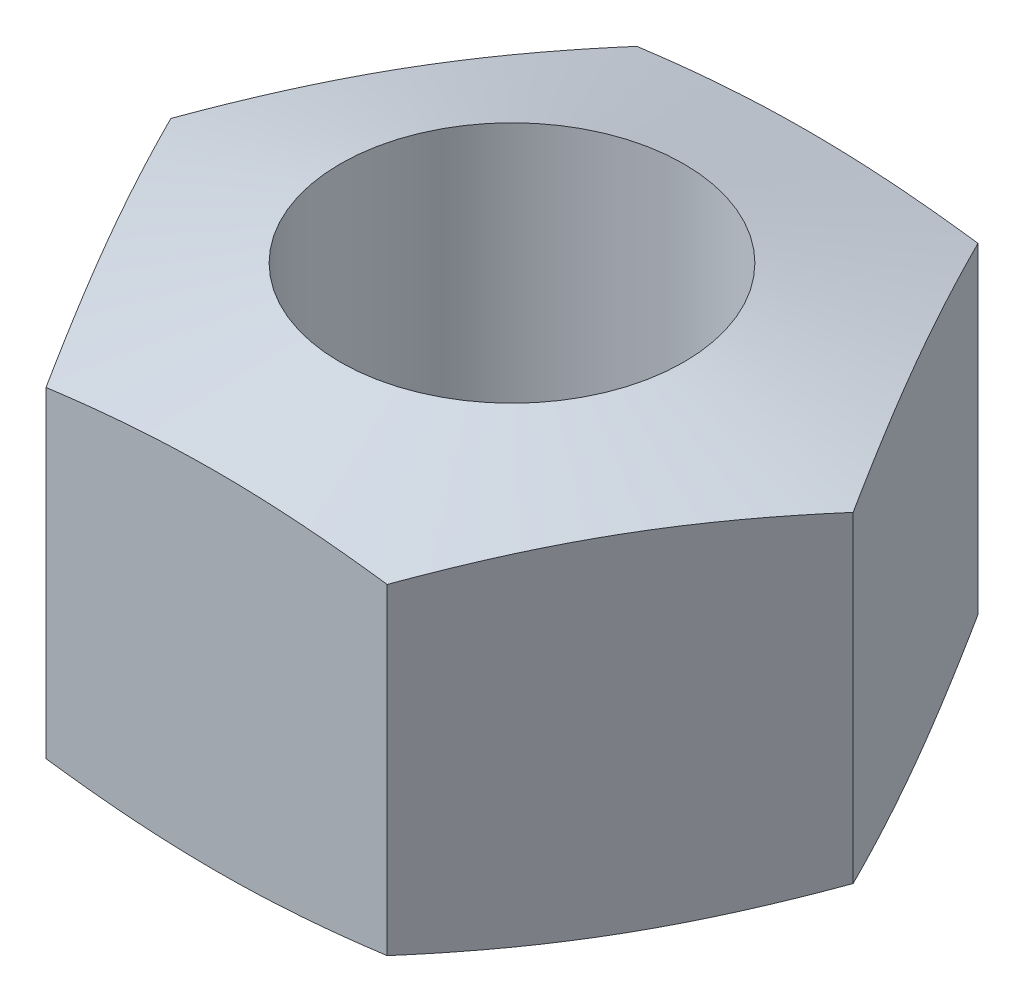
ISO-10303-21;
HEADER;
FILE_DESCRIPTION(('STEP AP214'),'2;1');
FILE_NAME('part.step','',(''),(''),'','','');
FILE_SCHEMA(('AUTOMOTIVE_DESIGN { 1 0 10303 214 1 1 1 1 }'));
ENDSEC;
DATA;
#1=APPLICATION_CONTEXT('core data for automotive mechanical design processes');
#2=APPLICATION_PROTOCOL_DEFINITION('international standard','automotive_design',2000,#1);
#3=PRODUCT_CONTEXT('',#1,'mechanical');
#4=PRODUCT('Part','Part','',(#3));
#5=PRODUCT_RELATED_PRODUCT_CATEGORY('part','',(#4));
#6=PRODUCT_DEFINITION_FORMATION('','',#4);
#7=PRODUCT_DEFINITION_CONTEXT('part definition',#1,'design');
#8=PRODUCT_DEFINITION('design','',#6,#7);
#9=PRODUCT_DEFINITION_SHAPE('','',#8);
#10=(LENGTH_UNIT() NAMED_UNIT(*) SI_UNIT(.MILLI.,.METRE.));
#11=(NAMED_UNIT(*) PLANE_ANGLE_UNIT() SI_UNIT($,.RADIAN.));
#12=(NAMED_UNIT(*) SI_UNIT($,.STERADIAN.) SOLID_ANGLE_UNIT());
#13=UNCERTAINTY_MEASURE_WITH_UNIT(LENGTH_MEASURE(1.E-05),#10,'distance_accuracy_value','');
#14=(GEOMETRIC_REPRESENTATION_CONTEXT(3) GLOBAL_UNCERTAINTY_ASSIGNED_CONTEXT((#13)) GLOBAL_UNIT_ASSIGNED_CONTEXT((#10,
#11,#12)) REPRESENTATION_CONTEXT('',''));
#15=CARTESIAN_POINT('',(0.,0.,0.));
#16=DIRECTION('',(0.,0.,1.));
#17=DIRECTION('',(1.,0.,0.));
#18=AXIS2_PLACEMENT_3D('',#15,#16,#17);
#19=CARTESIAN_POINT('',(1.24130307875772,1.5,2.14999999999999));
#20=DIRECTION('',(-0.866025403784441,0.,-0.499999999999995));
#21=DIRECTION('',(-0.499999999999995,0.,0.866025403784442));
#22=AXIS2_PLACEMENT_3D('',#19,#20,#21);
#23=PLANE('',#22);
#24=DIRECTION('',(0.,-1.,0.));
#25=VECTOR('',#24,1.);
#26=CARTESIAN_POINT('',(1.24130307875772,1.5,2.14999999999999));
#27=LINE('',#26,#25);
#28=CARTESIAN_POINT('',(1.24130307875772,1.16972417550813,2.14999999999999));
#29=VERTEX_POINT('',#28);
#30=CARTESIAN_POINT('',(1.24130307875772,-1.16972417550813,2.14999999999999));
#31=VERTEX_POINT('',#30);
#32=EDGE_CURVE('E107',#29,#31,#27,.T.);
#33=ORIENTED_EDGE('',*,*,#32,.T.);
#34=CARTESIAN_POINT('',(1.24118760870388,-1.16969323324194,2.15019999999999));
#35=CARTESIAN_POINT('',(1.29274536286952,-1.18351524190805,2.06089935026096));
#36=CARTESIAN_POINT('',(1.34439661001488,-1.19606344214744,1.97143676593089));
#37=CARTESIAN_POINT('',(1.44788155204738,-1.21810957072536,1.79219558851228));
#38=CARTESIAN_POINT('',(1.49971531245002,-1.22760625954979,1.70241688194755));
#39=CARTESIAN_POINT('',(1.60325094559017,-1.24299485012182,1.523087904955));
#40=CARTESIAN_POINT('',(1.65495211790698,-1.24890510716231,1.43353884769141));
#41=CARTESIAN_POINT('',(1.75842040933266,-1.25683016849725,1.25432650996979));
#42=CARTESIAN_POINT('',(1.81018751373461,-1.25884572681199,1.16466325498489));
#43=CARTESIAN_POINT('',(1.9137217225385,-1.25884572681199,0.985336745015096));
#44=CARTESIAN_POINT('',(1.96548882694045,-1.25683016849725,0.895673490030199));
#45=CARTESIAN_POINT('',(2.06895711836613,-1.24890510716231,0.716461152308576));
#46=CARTESIAN_POINT('',(2.12065829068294,-1.24299485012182,0.626912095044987));
#47=CARTESIAN_POINT('',(2.22419392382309,-1.22760625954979,0.447583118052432));
#48=CARTESIAN_POINT('',(2.27602768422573,-1.21810957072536,0.357804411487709));
#49=CARTESIAN_POINT('',(2.37951262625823,-1.19606344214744,0.178563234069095));
#50=CARTESIAN_POINT('',(2.4311638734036,-1.18351524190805,0.0891006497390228));
#51=CARTESIAN_POINT('',(2.48272162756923,-1.16969323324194,-0.000200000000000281));
#52=B_SPLINE_CURVE_WITH_KNOTS('',3,(#34,#35,#36,#37,#38,#39,#40,#41,#42,#43,#44,#45,#46,#47,#48,
#49,#50,#51),.UNSPECIFIED.,.F.,.F.,(4,2,2,2,2,2,2,2,4),(0.,0.312129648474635,0.62438592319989,
0.935030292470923,1.2456145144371,1.55619873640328,1.86684310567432,2.17909938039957,
2.49122902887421),.UNSPECIFIED.);
#53=CARTESIAN_POINT('',(2.48260615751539,-1.16972417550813,0.));
#54=VERTEX_POINT('',#53);
#55=EDGE_CURVE('E50',#31,#54,#52,.T.);
#56=ORIENTED_EDGE('',*,*,#55,.T.);
#57=DIRECTION('',(0.,-1.,0.));
#58=VECTOR('',#57,1.);
#59=CARTESIAN_POINT('',(2.48260615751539,1.5,0.));
#60=LINE('',#59,#58);
#61=CARTESIAN_POINT('',(2.48260615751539,1.16972417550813,0.));
#62=VERTEX_POINT('',#61);
#63=EDGE_CURVE('E12',#62,#54,#60,.T.);
#64=ORIENTED_EDGE('',*,*,#63,.F.);
#65=CARTESIAN_POINT('',(1.24118760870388,1.16969323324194,2.15019999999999));
#66=CARTESIAN_POINT('',(1.29274536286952,1.18351524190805,2.06089935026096));
#67=CARTESIAN_POINT('',(1.34439661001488,1.19606344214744,1.97143676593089));
#68=CARTESIAN_POINT('',(1.44788155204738,1.21810957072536,1.79219558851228));
#69=CARTESIAN_POINT('',(1.49971531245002,1.22760625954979,1.70241688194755));
#70=CARTESIAN_POINT('',(1.60325094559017,1.24299485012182,1.523087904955));
#71=CARTESIAN_POINT('',(1.65495211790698,1.24890510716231,1.43353884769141));
#72=CARTESIAN_POINT('',(1.75842040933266,1.25683016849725,1.25432650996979));
#73=CARTESIAN_POINT('',(1.81018751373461,1.25884572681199,1.16466325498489));
#74=CARTESIAN_POINT('',(1.9137217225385,1.25884572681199,0.985336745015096));
#75=CARTESIAN_POINT('',(1.96548882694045,1.25683016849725,0.895673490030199));
#76=CARTESIAN_POINT('',(2.06895711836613,1.24890510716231,0.716461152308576));
#77=CARTESIAN_POINT('',(2.12065829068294,1.24299485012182,0.626912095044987));
#78=CARTESIAN_POINT('',(2.22419392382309,1.22760625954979,0.447583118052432));
#79=CARTESIAN_POINT('',(2.27602768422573,1.21810957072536,0.357804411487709));
#80=CARTESIAN_POINT('',(2.37951262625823,1.19606344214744,0.178563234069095));
#81=CARTESIAN_POINT('',(2.4311638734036,1.18351524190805,0.0891006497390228));
#82=CARTESIAN_POINT('',(2.48272162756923,1.16969323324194,-0.000200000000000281));
#83=B_SPLINE_CURVE_WITH_KNOTS('',3,(#65,#66,#67,#68,#69,#70,#71,#72,#73,#74,#75,#76,#77,#78,#79,
#80,#81,#82),.UNSPECIFIED.,.F.,.F.,(4,2,2,2,2,2,2,2,4),(0.,0.312129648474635,0.62438592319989,
0.935030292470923,1.2456145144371,1.55619873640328,1.86684310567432,2.17909938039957,
2.49122902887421),.UNSPECIFIED.);
#84=EDGE_CURVE('E111',#29,#62,#83,.T.);
#85=ORIENTED_EDGE('',*,*,#84,.F.);
#86=EDGE_LOOP('',(#33,#56,#64,#85));
#87=FACE_BOUND('',#86,.T.);
#88=ADVANCED_FACE('F35',(#87),#23,.F.);
#89=CARTESIAN_POINT('',(2.48260615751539,1.5,0.));
#90=DIRECTION('',(-0.866025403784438,0.,0.500000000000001));
#91=DIRECTION('',(0.500000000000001,0.,0.866025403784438));
#92=AXIS2_PLACEMENT_3D('',#89,#90,#91);
#93=PLANE('',#92);
#94=ORIENTED_EDGE('',*,*,#63,.T.);
#95=CARTESIAN_POINT('',(2.48272162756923,-1.16969323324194,0.000200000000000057));
#96=CARTESIAN_POINT('',(2.4311638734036,-1.18351524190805,-0.0891006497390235));
#97=CARTESIAN_POINT('',(2.37951262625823,-1.19606344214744,-0.178563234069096));
#98=CARTESIAN_POINT('',(2.27602768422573,-1.21810957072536,-0.357804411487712));
#99=CARTESIAN_POINT('',(2.22419392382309,-1.2276062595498,-0.447583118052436));
#100=CARTESIAN_POINT('',(2.12065829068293,-1.24299485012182,-0.626912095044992));
#101=CARTESIAN_POINT('',(2.06895711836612,-1.24890510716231,-0.716461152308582));
#102=CARTESIAN_POINT('',(1.96548882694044,-1.25683016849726,-0.895673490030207));
#103=CARTESIAN_POINT('',(1.91372172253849,-1.25884572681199,-0.985336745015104));
#104=CARTESIAN_POINT('',(1.81018751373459,-1.25884572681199,-1.1646632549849));
#105=CARTESIAN_POINT('',(1.75842040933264,-1.25683016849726,-1.2543265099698));
#106=CARTESIAN_POINT('',(1.65495211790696,-1.24890510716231,-1.43353884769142));
#107=CARTESIAN_POINT('',(1.60325094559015,-1.24299485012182,-1.52308790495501));
#108=CARTESIAN_POINT('',(1.49971531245,-1.2276062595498,-1.70241688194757));
#109=CARTESIAN_POINT('',(1.44788155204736,-1.21810957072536,-1.79219558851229));
#110=CARTESIAN_POINT('',(1.34439661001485,-1.19606344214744,-1.97143676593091));
#111=CARTESIAN_POINT('',(1.29274536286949,-1.18351524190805,-2.06089935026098));
#112=CARTESIAN_POINT('',(1.24118760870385,-1.16969323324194,-2.1502));
#113=B_SPLINE_CURVE_WITH_KNOTS('',3,(#95,#96,#97,#98,#99,#100,#101,#102,#103,#104,#105,#106,
#107,#108,#109,#110,#111,#112),.UNSPECIFIED.,.F.,.F.,(4,2,2,2,2,2,2,2,4),(0.,0.312129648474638,
0.624385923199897,0.935030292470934,1.24561451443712,1.5561987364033,1.86684310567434,
2.1790993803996,2.49122902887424),.UNSPECIFIED.);
#114=CARTESIAN_POINT('',(1.24130307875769,-1.16972417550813,-2.15));
#115=VERTEX_POINT('',#114);
#116=EDGE_CURVE('E131',#54,#115,#113,.T.);
#117=ORIENTED_EDGE('',*,*,#116,.T.);
#118=DIRECTION('',(0.,-1.,0.));
#119=VECTOR('',#118,1.);
#120=CARTESIAN_POINT('',(1.24130307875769,1.5,-2.15));
#121=LINE('',#120,#119);
#122=CARTESIAN_POINT('',(1.24130307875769,1.16972417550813,-2.15));
#123=VERTEX_POINT('',#122);
#124=EDGE_CURVE('E43',#123,#115,#121,.T.);
#125=ORIENTED_EDGE('',*,*,#124,.F.);
#126=CARTESIAN_POINT('',(2.48272162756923,1.16969323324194,0.000200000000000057));
#127=CARTESIAN_POINT('',(2.4311638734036,1.18351524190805,-0.0891006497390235));
#128=CARTESIAN_POINT('',(2.37951262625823,1.19606344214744,-0.178563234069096));
#129=CARTESIAN_POINT('',(2.27602768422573,1.21810957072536,-0.357804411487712));
#130=CARTESIAN_POINT('',(2.22419392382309,1.2276062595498,-0.447583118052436));
#131=CARTESIAN_POINT('',(2.12065829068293,1.24299485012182,-0.626912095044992));
#132=CARTESIAN_POINT('',(2.06895711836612,1.24890510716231,-0.716461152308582));
#133=CARTESIAN_POINT('',(1.96548882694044,1.25683016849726,-0.895673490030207));
#134=CARTESIAN_POINT('',(1.91372172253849,1.25884572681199,-0.985336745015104));
#135=CARTESIAN_POINT('',(1.81018751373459,1.25884572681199,-1.1646632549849));
#136=CARTESIAN_POINT('',(1.75842040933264,1.25683016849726,-1.2543265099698));
#137=CARTESIAN_POINT('',(1.65495211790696,1.24890510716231,-1.43353884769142));
#138=CARTESIAN_POINT('',(1.60325094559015,1.24299485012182,-1.52308790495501));
#139=CARTESIAN_POINT('',(1.49971531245,1.2276062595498,-1.70241688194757));
#140=CARTESIAN_POINT('',(1.44788155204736,1.21810957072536,-1.79219558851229));
#141=CARTESIAN_POINT('',(1.34439661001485,1.19606344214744,-1.97143676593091));
#142=CARTESIAN_POINT('',(1.29274536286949,1.18351524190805,-2.06089935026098));
#143=CARTESIAN_POINT('',(1.24118760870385,1.16969323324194,-2.1502));
#144=B_SPLINE_CURVE_WITH_KNOTS('',3,(#126,#127,#128,#129,#130,#131,#132,#133,#134,#135,#136,
#137,#138,#139,#140,#141,#142,#143),.UNSPECIFIED.,.F.,.F.,(4,2,2,2,2,2,2,2,4),(0.,
0.312129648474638,0.624385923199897,0.935030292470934,1.24561451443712,1.5561987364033,
1.86684310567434,2.1790993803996,2.49122902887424),.UNSPECIFIED.);
#145=EDGE_CURVE('E129',#62,#123,#144,.T.);
#146=ORIENTED_EDGE('',*,*,#145,.F.);
#147=EDGE_LOOP('',(#94,#117,#125,#146));
#148=FACE_BOUND('',#147,.T.);
#149=ADVANCED_FACE('F128',(#148),#93,.F.);
#150=CARTESIAN_POINT('',(1.24130307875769,1.5,-2.15));
#151=DIRECTION('',(0.,0.,1.));
#152=DIRECTION('',(1.,0.,0.));
#153=AXIS2_PLACEMENT_3D('',#150,#151,#152);
#154=PLANE('',#153);
#155=ORIENTED_EDGE('',*,*,#124,.T.);
#156=CARTESIAN_POINT('',(4.95291292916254,-0.388163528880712,-2.15000000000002));
#157=CARTESIAN_POINT('',(4.74158537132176,-0.440063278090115,-2.15000000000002));
#158=CARTESIAN_POINT('',(4.53015042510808,-0.491542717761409,-2.15000000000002));
#159=CARTESIAN_POINT('',(4.10692270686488,-0.593085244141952,-2.15000000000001));
#160=CARTESIAN_POINT('',(3.89512990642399,-0.643148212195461,-2.15000000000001));
#161=CARTESIAN_POINT('',(3.46799210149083,-0.741987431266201,-2.15000000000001));
#162=CARTESIAN_POINT('',(3.25264026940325,-0.790734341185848,-2.15000000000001));
#163=CARTESIAN_POINT('',(2.82123625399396,-0.885085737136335,-2.15000000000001));
#164=CARTESIAN_POINT('',(2.60518405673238,-0.930690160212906,-2.15000000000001));
#165=CARTESIAN_POINT('',(2.17931820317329,-1.01550829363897,-2.15000000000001));
#166=CARTESIAN_POINT('',(1.96953729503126,-1.05488461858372,-2.15000000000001));
#167=CARTESIAN_POINT('',(1.54865098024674,-1.12629851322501,-2.15000000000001));
#168=CARTESIAN_POINT('',(1.33754545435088,-1.15833541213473,-2.15));
#169=CARTESIAN_POINT('',(1.02059698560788,-1.19771818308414,-2.15));
#170=CARTESIAN_POINT('',(0.915293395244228,-1.20937274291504,-2.15));
#171=CARTESIAN_POINT('',(0.704370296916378,-1.22929453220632,-2.15));
#172=CARTESIAN_POINT('',(0.598750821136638,-1.23756209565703,-2.15));
#173=CARTESIAN_POINT('',(0.387330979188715,-1.25022189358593,-2.15));
#174=CARTESIAN_POINT('',(0.281530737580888,-1.25461616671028,-2.15));
#175=CARTESIAN_POINT('',(0.0698390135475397,-1.25923503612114,-2.15));
#176=CARTESIAN_POINT('',(-0.0360524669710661,-1.25945971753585,-2.15));
#177=CARTESIAN_POINT('',(-0.242039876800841,-1.25582570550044,-2.15));
#178=CARTESIAN_POINT('',(-0.342139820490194,-1.25218697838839,-2.15));
#179=CARTESIAN_POINT('',(-0.54214711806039,-1.24139321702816,-2.15));
#180=CARTESIAN_POINT('',(-0.642054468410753,-1.23423811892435,-2.15));
#181=CARTESIAN_POINT('',(-0.941463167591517,-1.20806990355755,-2.15));
#182=CARTESIAN_POINT('',(-1.14055371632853,-1.1843562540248,-2.15));
#183=CARTESIAN_POINT('',(-1.53887704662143,-1.12795419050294,-2.14999999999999));
#184=CARTESIAN_POINT('',(-1.73810013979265,-1.09520115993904,-2.14999999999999));
#185=CARTESIAN_POINT('',(-2.13545251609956,-1.02393314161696,-2.14999999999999));
#186=CARTESIAN_POINT('',(-2.33358200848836,-0.985419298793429,-2.14999999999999));
#187=CARTESIAN_POINT('',(-2.73553842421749,-0.903327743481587,-2.14999999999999));
#188=CARTESIAN_POINT('',(-2.93933954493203,-0.859625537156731,-2.14999999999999));
#189=CARTESIAN_POINT('',(-3.3463677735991,-0.769605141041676,-2.14999999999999));
#190=CARTESIAN_POINT('',(-3.54959485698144,-0.723286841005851,-2.14999999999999));
#191=CARTESIAN_POINT('',(-3.95301014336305,-0.629498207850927,-2.14999999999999));
#192=CARTESIAN_POINT('',(-4.15320364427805,-0.582050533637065,-2.14999999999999));
#193=CARTESIAN_POINT('',(-4.55326819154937,-0.485917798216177,-2.14999999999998));
#194=CARTESIAN_POINT('',(-4.75313927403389,-0.437232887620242,-2.14999999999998));
#195=CARTESIAN_POINT('',(-4.95291292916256,-0.388163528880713,-2.14999999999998));
#196=B_SPLINE_CURVE_WITH_KNOTS('',3,(#156,#157,#158,#159,#160,#161,#162,#163,#164,#165,#166,
#167,#168,#169,#170,#171,#172,#173,#174,#175,#176,#177,#178,#179,#180,#181,#182,#183,#184,#185,
#186,#187,#188,#189,#190,#191,#192,#193,#194,#195),.UNSPECIFIED.,.F.,.F.,(4,2,2,2,2,2,2,2,2,2,2,
2,2,2,2,2,2,2,2,4),(0.,0.652827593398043,1.30570971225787,1.96809624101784,2.6304960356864,
3.27076389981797,3.91109025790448,4.2288856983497,4.54664979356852,4.86424653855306,
5.18183679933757,5.48226785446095,5.78270436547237,6.38386923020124,6.98944799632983,
7.59490656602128,8.22018452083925,8.8454888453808,9.46270282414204,10.0798420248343),.UNSPECIFIED.);
#197=CARTESIAN_POINT('',(-1.24130307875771,-1.16972417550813,-2.15));
#198=VERTEX_POINT('',#197);
#199=EDGE_CURVE('E123',#115,#198,#196,.T.);
#200=ORIENTED_EDGE('',*,*,#199,.T.);
#201=DIRECTION('',(0.,-1.,0.));
#202=VECTOR('',#201,1.);
#203=CARTESIAN_POINT('',(-1.24130307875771,1.5,-2.15));
#204=LINE('',#203,#202);
#205=CARTESIAN_POINT('',(-1.24130307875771,1.16972417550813,-2.15));
#206=VERTEX_POINT('',#205);
#207=EDGE_CURVE('E109',#206,#198,#204,.T.);
#208=ORIENTED_EDGE('',*,*,#207,.F.);
#209=CARTESIAN_POINT('',(5.03842661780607,0.367116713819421,-2.15000000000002));
#210=CARTESIAN_POINT('',(4.82351930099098,0.420037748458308,-2.15000000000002));
#211=CARTESIAN_POINT('',(4.60850617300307,0.472543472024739,-2.15000000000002));
#212=CARTESIAN_POINT('',(4.17812367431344,0.576149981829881,-2.15000000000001));
#213=CARTESIAN_POINT('',(3.96275427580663,0.627250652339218,-2.15000000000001));
#214=CARTESIAN_POINT('',(3.52833079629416,0.728211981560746,-2.15000000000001));
#215=CARTESIAN_POINT('',(3.30926971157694,0.778042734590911,-2.15000000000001));
#216=CARTESIAN_POINT('',(2.87044844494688,0.8745639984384,-2.15000000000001));
#217=CARTESIAN_POINT('',(2.65068825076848,0.921254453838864,-2.15000000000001));
#218=CARTESIAN_POINT('',(2.2176121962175,1.00817904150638,-2.15000000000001));
#219=CARTESIAN_POINT('',(2.00433037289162,1.04857836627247,-2.15000000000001));
#220=CARTESIAN_POINT('',(1.68342706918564,1.10358955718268,-2.15000000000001));
#221=CARTESIAN_POINT('',(1.57628739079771,1.12099647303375,-2.15000000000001));
#222=CARTESIAN_POINT('',(1.36164363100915,1.15344407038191,-2.15));
#223=CARTESIAN_POINT('',(1.25413954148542,1.16848469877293,-2.15));
#224=CARTESIAN_POINT('',(1.03958383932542,1.19553338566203,-2.15));
#225=CARTESIAN_POINT('',(0.932535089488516,1.20756384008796,-2.15));
#226=CARTESIAN_POINT('',(0.718109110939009,1.2281528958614,-2.15));
#227=CARTESIAN_POINT('',(0.610731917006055,1.23671185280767,-2.15));
#228=CARTESIAN_POINT('',(0.395789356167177,1.24983593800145,-2.15));
#229=CARTESIAN_POINT('',(0.28822412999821,1.25440332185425,-2.15));
#230=CARTESIAN_POINT('',(0.0729968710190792,1.25922990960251,-2.15));
#231=CARTESIAN_POINT('',(-0.0346651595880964,1.25948920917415,-2.15));
#232=CARTESIAN_POINT('',(-0.244178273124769,1.25578320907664,-2.15));
#233=CARTESIAN_POINT('',(-0.34603346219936,1.25204216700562,-2.15));
#234=CARTESIAN_POINT('',(-0.549542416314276,1.24092499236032,-2.15));
#235=CARTESIAN_POINT('',(-0.651196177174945,1.23354878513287,-2.15));
#236=CARTESIAN_POINT('',(-0.955835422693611,1.20657580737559,-2.15));
#237=CARTESIAN_POINT('',(-1.15839170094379,1.18213734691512,-2.15));
#238=CARTESIAN_POINT('',(-1.56367319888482,1.12409713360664,-2.14999999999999));
#239=CARTESIAN_POINT('',(-1.76638811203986,1.09042748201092,-2.14999999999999));
#240=CARTESIAN_POINT('',(-2.1706983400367,1.01726149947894,-2.14999999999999));
#241=CARTESIAN_POINT('',(-2.37229388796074,0.977766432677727,-2.14999999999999));
#242=CARTESIAN_POINT('',(-2.7813884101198,0.893641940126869,-2.14999999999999));
#243=CARTESIAN_POINT('',(-2.98886087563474,0.848885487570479,-2.14999999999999));
#244=CARTESIAN_POINT('',(-3.40322965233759,0.756755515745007,-2.14999999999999));
#245=CARTESIAN_POINT('',(-3.61012593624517,0.709381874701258,-2.14999999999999));
#246=CARTESIAN_POINT('',(-4.02076237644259,0.613518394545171,-2.14999999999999));
#247=CARTESIAN_POINT('',(-4.22450797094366,0.565051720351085,-2.14999999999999));
#248=CARTESIAN_POINT('',(-4.63167674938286,0.466888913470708,-2.14999999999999));
#249=CARTESIAN_POINT('',(-4.83509996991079,0.417192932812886,-2.14999999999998));
#250=CARTESIAN_POINT('',(-5.03842661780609,0.367116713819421,-2.14999999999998));
#251=B_SPLINE_CURVE_WITH_KNOTS('',3,(#209,#210,#211,#212,#213,#214,#215,#216,#217,#218,#219,
#220,#221,#222,#223,#224,#225,#226,#227,#228,#229,#230,#231,#232,#233,#234,#235,#236,#237,#238,
#239,#240,#241,#242,#243,#244,#245,#246,#247,#248,#249,#250),.UNSPECIFIED.,.F.,.F.,(4,2,2,2,2,2,
2,2,2,2,2,2,2,2,2,2,2,2,2,2,4),(0.,0.663986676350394,1.32802788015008,2.00198363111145,
2.67595127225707,3.32707544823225,3.65268886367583,3.97830958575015,4.30143036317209,
4.62451803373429,4.94742301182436,5.27032081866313,5.57602178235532,5.8817290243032,
6.49346444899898,7.10982605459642,7.72605410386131,8.36276525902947,8.99950606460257,
9.62779442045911,10.2560054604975),.UNSPECIFIED.);
#252=EDGE_CURVE('E124',#123,#206,#251,.T.);
#253=ORIENTED_EDGE('',*,*,#252,.F.);
#254=EDGE_LOOP('',(#155,#200,#208,#253));
#255=FACE_BOUND('',#254,.T.);
#256=ADVANCED_FACE('F121',(#255),#154,.F.);
#257=CARTESIAN_POINT('',(-1.24130307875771,1.5,-2.15));
#258=DIRECTION('',(0.866025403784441,0.,0.499999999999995));
#259=DIRECTION('',(0.499999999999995,0.,-0.866025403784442));
#260=AXIS2_PLACEMENT_3D('',#257,#258,#259);
#261=PLANE('',#260);
#262=ORIENTED_EDGE('',*,*,#207,.T.);
#263=CARTESIAN_POINT('',(-1.24118760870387,-1.16969323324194,-2.1502));
#264=CARTESIAN_POINT('',(-1.2927453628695,-1.18351524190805,-2.06089935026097));
#265=CARTESIAN_POINT('',(-1.34439661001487,-1.19606344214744,-1.9714367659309));
#266=CARTESIAN_POINT('',(-1.44788155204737,-1.21810957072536,-1.79219558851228));
#267=CARTESIAN_POINT('',(-1.49971531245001,-1.2276062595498,-1.70241688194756));
#268=CARTESIAN_POINT('',(-1.60325094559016,-1.24299485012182,-1.523087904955));
#269=CARTESIAN_POINT('',(-1.65495211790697,-1.24890510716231,-1.43353884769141));
#270=CARTESIAN_POINT('',(-1.75842040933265,-1.25683016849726,-1.25432650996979));
#271=CARTESIAN_POINT('',(-1.8101875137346,-1.25884572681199,-1.16466325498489));
#272=CARTESIAN_POINT('',(-1.9137217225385,-1.25884572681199,-0.985336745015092));
#273=CARTESIAN_POINT('',(-1.96548882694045,-1.25683016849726,-0.895673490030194));
#274=CARTESIAN_POINT('',(-2.06895711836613,-1.24890510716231,-0.716461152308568));
#275=CARTESIAN_POINT('',(-2.12065829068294,-1.24299485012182,-0.626912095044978));
#276=CARTESIAN_POINT('',(-2.22419392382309,-1.2276062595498,-0.447583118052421));
#277=CARTESIAN_POINT('',(-2.27602768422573,-1.21810957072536,-0.357804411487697));
#278=CARTESIAN_POINT('',(-2.37951262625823,-1.19606344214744,-0.178563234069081));
#279=CARTESIAN_POINT('',(-2.4311638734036,-1.18351524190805,-0.0891006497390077));
#280=CARTESIAN_POINT('',(-2.48272162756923,-1.16969323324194,0.000200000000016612));
#281=B_SPLINE_CURVE_WITH_KNOTS('',3,(#263,#264,#265,#266,#267,#268,#269,#270,#271,#272,#273,
#274,#275,#276,#277,#278,#279,#280),.UNSPECIFIED.,.F.,.F.,(4,2,2,2,2,2,2,2,4),(0.,
0.312129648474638,0.624385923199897,0.935030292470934,1.24561451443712,1.5561987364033,
1.86684310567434,2.1790993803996,2.49122902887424),.UNSPECIFIED.);
#282=CARTESIAN_POINT('',(-2.48260615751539,-1.16972417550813,0.));
#283=VERTEX_POINT('',#282);
#284=EDGE_CURVE('E103',#198,#283,#281,.T.);
#285=ORIENTED_EDGE('',*,*,#284,.T.);
#286=DIRECTION('',(0.,-1.,0.));
#287=VECTOR('',#286,1.);
#288=CARTESIAN_POINT('',(-2.48260615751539,1.5,0.));
#289=LINE('',#288,#287);
#290=CARTESIAN_POINT('',(-2.48260615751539,1.16972417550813,0.));
#291=VERTEX_POINT('',#290);
#292=EDGE_CURVE('E102',#291,#283,#289,.T.);
#293=ORIENTED_EDGE('',*,*,#292,.F.);
#294=CARTESIAN_POINT('',(-1.24118760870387,1.16969323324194,-2.1502));
#295=CARTESIAN_POINT('',(-1.2927453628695,1.18351524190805,-2.06089935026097));
#296=CARTESIAN_POINT('',(-1.34439661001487,1.19606344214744,-1.9714367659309));
#297=CARTESIAN_POINT('',(-1.44788155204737,1.21810957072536,-1.79219558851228));
#298=CARTESIAN_POINT('',(-1.49971531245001,1.2276062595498,-1.70241688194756));
#299=CARTESIAN_POINT('',(-1.60325094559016,1.24299485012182,-1.523087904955));
#300=CARTESIAN_POINT('',(-1.65495211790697,1.24890510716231,-1.43353884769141));
#301=CARTESIAN_POINT('',(-1.75842040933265,1.25683016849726,-1.25432650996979));
#302=CARTESIAN_POINT('',(-1.8101875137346,1.25884572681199,-1.16466325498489));
#303=CARTESIAN_POINT('',(-1.9137217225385,1.25884572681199,-0.985336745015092));
#304=CARTESIAN_POINT('',(-1.96548882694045,1.25683016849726,-0.895673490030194));
#305=CARTESIAN_POINT('',(-2.06895711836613,1.24890510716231,-0.716461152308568));
#306=CARTESIAN_POINT('',(-2.12065829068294,1.24299485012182,-0.626912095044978));
#307=CARTESIAN_POINT('',(-2.22419392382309,1.2276062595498,-0.447583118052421));
#308=CARTESIAN_POINT('',(-2.27602768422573,1.21810957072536,-0.357804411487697));
#309=CARTESIAN_POINT('',(-2.37951262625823,1.19606344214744,-0.178563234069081));
#310=CARTESIAN_POINT('',(-2.4311638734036,1.18351524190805,-0.0891006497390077));
#311=CARTESIAN_POINT('',(-2.48272162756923,1.16969323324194,0.000200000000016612));
#312=B_SPLINE_CURVE_WITH_KNOTS('',3,(#294,#295,#296,#297,#298,#299,#300,#301,#302,#303,#304,
#305,#306,#307,#308,#309,#310,#311),.UNSPECIFIED.,.F.,.F.,(4,2,2,2,2,2,2,2,4),(0.,
0.312129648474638,0.624385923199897,0.935030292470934,1.24561451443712,1.5561987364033,
1.86684310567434,2.1790993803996,2.49122902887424),.UNSPECIFIED.);
#313=EDGE_CURVE('E189',#206,#291,#312,.T.);
#314=ORIENTED_EDGE('',*,*,#313,.F.);
#315=EDGE_LOOP('',(#262,#285,#293,#314));
#316=FACE_BOUND('',#315,.T.);
#317=ADVANCED_FACE('F181',(#316),#261,.F.);
#318=CARTESIAN_POINT('',(-2.48260615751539,1.5,0.));
#319=DIRECTION('',(0.866025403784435,0.,-0.500000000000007));
#320=DIRECTION('',(-0.500000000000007,0.,-0.866025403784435));
#321=AXIS2_PLACEMENT_3D('',#318,#319,#320);
#322=PLANE('',#321);
#323=ORIENTED_EDGE('',*,*,#292,.T.);
#324=CARTESIAN_POINT('',(-2.48272162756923,-1.16969323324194,-0.000199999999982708));
#325=CARTESIAN_POINT('',(-2.4311638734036,-1.18351524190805,0.0891006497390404));
#326=CARTESIAN_POINT('',(-2.37951262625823,-1.19606344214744,0.178563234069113));
#327=CARTESIAN_POINT('',(-2.27602768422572,-1.21810957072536,0.357804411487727));
#328=CARTESIAN_POINT('',(-2.22419392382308,-1.2276062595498,0.447583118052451));
#329=CARTESIAN_POINT('',(-2.12065829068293,-1.24299485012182,0.626912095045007));
#330=CARTESIAN_POINT('',(-2.06895711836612,-1.24890510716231,0.716461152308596));
#331=CARTESIAN_POINT('',(-1.96548882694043,-1.25683016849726,0.89567349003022));
#332=CARTESIAN_POINT('',(-1.91372172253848,-1.25884572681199,0.985336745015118));
#333=CARTESIAN_POINT('',(-1.81018751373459,-1.25884572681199,1.16466325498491));
#334=CARTESIAN_POINT('',(-1.75842040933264,-1.25683016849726,1.25432650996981));
#335=CARTESIAN_POINT('',(-1.65495211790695,-1.24890510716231,1.43353884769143));
#336=CARTESIAN_POINT('',(-1.60325094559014,-1.24299485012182,1.52308790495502));
#337=CARTESIAN_POINT('',(-1.49971531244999,-1.2276062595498,1.70241688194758));
#338=CARTESIAN_POINT('',(-1.44788155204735,-1.21810957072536,1.7921955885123));
#339=CARTESIAN_POINT('',(-1.34439661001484,-1.19606344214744,1.97143676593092));
#340=CARTESIAN_POINT('',(-1.29274536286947,-1.18351524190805,2.06089935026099));
#341=CARTESIAN_POINT('',(-1.24118760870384,-1.16969323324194,2.15020000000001));
#342=B_SPLINE_CURVE_WITH_KNOTS('',3,(#324,#325,#326,#327,#328,#329,#330,#331,#332,#333,#334,
#335,#336,#337,#338,#339,#340,#341),.UNSPECIFIED.,.F.,.F.,(4,2,2,2,2,2,2,2,4),(0.,
0.312129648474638,0.624385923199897,0.935030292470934,1.24561451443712,1.5561987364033,
1.86684310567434,2.1790993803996,2.49122902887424),.UNSPECIFIED.);
#343=CARTESIAN_POINT('',(-1.24130307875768,-1.16972417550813,2.15000000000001));
#344=VERTEX_POINT('',#343);
#345=EDGE_CURVE('E88',#283,#344,#342,.T.);
#346=ORIENTED_EDGE('',*,*,#345,.T.);
#347=DIRECTION('',(0.,-1.,0.));
#348=VECTOR('',#347,1.);
#349=CARTESIAN_POINT('',(-1.24130307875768,1.5,2.15000000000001));
#350=LINE('',#349,#348);
#351=CARTESIAN_POINT('',(-1.24130307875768,1.16972417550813,2.15000000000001));
#352=VERTEX_POINT('',#351);
#353=EDGE_CURVE('E100',#352,#344,#350,.T.);
#354=ORIENTED_EDGE('',*,*,#353,.F.);
#355=CARTESIAN_POINT('',(-2.48272162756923,1.16969323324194,-0.000199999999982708));
#356=CARTESIAN_POINT('',(-2.4311638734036,1.18351524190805,0.0891006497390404));
#357=CARTESIAN_POINT('',(-2.37951262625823,1.19606344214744,0.178563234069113));
#358=CARTESIAN_POINT('',(-2.27602768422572,1.21810957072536,0.357804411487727));
#359=CARTESIAN_POINT('',(-2.22419392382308,1.2276062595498,0.447583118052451));
#360=CARTESIAN_POINT('',(-2.12065829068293,1.24299485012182,0.626912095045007));
#361=CARTESIAN_POINT('',(-2.06895711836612,1.24890510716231,0.716461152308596));
#362=CARTESIAN_POINT('',(-1.96548882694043,1.25683016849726,0.89567349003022));
#363=CARTESIAN_POINT('',(-1.91372172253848,1.25884572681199,0.985336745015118));
#364=CARTESIAN_POINT('',(-1.81018751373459,1.25884572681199,1.16466325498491));
#365=CARTESIAN_POINT('',(-1.75842040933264,1.25683016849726,1.25432650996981));
#366=CARTESIAN_POINT('',(-1.65495211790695,1.24890510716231,1.43353884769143));
#367=CARTESIAN_POINT('',(-1.60325094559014,1.24299485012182,1.52308790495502));
#368=CARTESIAN_POINT('',(-1.49971531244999,1.2276062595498,1.70241688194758));
#369=CARTESIAN_POINT('',(-1.44788155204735,1.21810957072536,1.7921955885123));
#370=CARTESIAN_POINT('',(-1.34439661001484,1.19606344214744,1.97143676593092));
#371=CARTESIAN_POINT('',(-1.29274536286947,1.18351524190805,2.06089935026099));
#372=CARTESIAN_POINT('',(-1.24118760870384,1.16969323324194,2.15020000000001));
#373=B_SPLINE_CURVE_WITH_KNOTS('',3,(#355,#356,#357,#358,#359,#360,#361,#362,#363,#364,#365,
#366,#367,#368,#369,#370,#371,#372),.UNSPECIFIED.,.F.,.F.,(4,2,2,2,2,2,2,2,4),(0.,
0.312129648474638,0.624385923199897,0.935030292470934,1.24561451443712,1.5561987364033,
1.86684310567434,2.1790993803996,2.49122902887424),.UNSPECIFIED.);
#374=EDGE_CURVE('E58',#291,#352,#373,.T.);
#375=ORIENTED_EDGE('',*,*,#374,.F.);
#376=EDGE_LOOP('',(#323,#346,#354,#375));
#377=FACE_BOUND('',#376,.T.);
#378=ADVANCED_FACE('F99',(#377),#322,.F.);
#379=CARTESIAN_POINT('',(-1.24130307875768,1.5,2.15000000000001));
#380=DIRECTION('',(0.,0.,-1.));
#381=DIRECTION('',(-1.,0.,0.));
#382=AXIS2_PLACEMENT_3D('',#379,#380,#381);
#383=PLANE('',#382);
#384=ORIENTED_EDGE('',*,*,#353,.T.);
#385=CARTESIAN_POINT('',(-4.95291292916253,-0.388163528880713,2.15000000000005));
#386=CARTESIAN_POINT('',(-4.74158537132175,-0.440063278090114,2.15000000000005));
#387=CARTESIAN_POINT('',(-4.53015042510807,-0.491542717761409,2.15000000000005));
#388=CARTESIAN_POINT('',(-4.10692270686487,-0.593085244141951,2.15000000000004));
#389=CARTESIAN_POINT('',(-3.89512990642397,-0.643148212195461,2.15000000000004));
#390=CARTESIAN_POINT('',(-3.46799210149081,-0.741987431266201,2.15000000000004));
#391=CARTESIAN_POINT('',(-3.25264026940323,-0.790734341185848,2.15000000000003));
#392=CARTESIAN_POINT('',(-2.82123625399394,-0.885085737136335,2.15000000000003));
#393=CARTESIAN_POINT('',(-2.60518405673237,-0.930690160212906,2.15000000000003));
#394=CARTESIAN_POINT('',(-2.17931820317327,-1.01550829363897,2.15000000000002));
#395=CARTESIAN_POINT('',(-1.96953729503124,-1.05488461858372,2.15000000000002));
#396=CARTESIAN_POINT('',(-1.54865098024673,-1.12629851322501,2.15000000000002));
#397=CARTESIAN_POINT('',(-1.33754545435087,-1.15833541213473,2.15000000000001));
#398=CARTESIAN_POINT('',(-1.02059698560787,-1.19771818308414,2.15000000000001));
#399=CARTESIAN_POINT('',(-0.915293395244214,-1.20937274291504,2.15000000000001));
#400=CARTESIAN_POINT('',(-0.704370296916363,-1.22929453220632,2.15000000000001));
#401=CARTESIAN_POINT('',(-0.598750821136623,-1.23756209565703,2.15000000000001));
#402=CARTESIAN_POINT('',(-0.3873309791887,-1.25022189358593,2.15));
#403=CARTESIAN_POINT('',(-0.281530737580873,-1.25461616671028,2.15));
#404=CARTESIAN_POINT('',(-0.0698390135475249,-1.25923503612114,2.15));
#405=CARTESIAN_POINT('',(0.0360524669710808,-1.25945971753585,2.15));
#406=CARTESIAN_POINT('',(0.242039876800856,-1.25582570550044,2.15));
#407=CARTESIAN_POINT('',(0.342139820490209,-1.25218697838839,2.15));
#408=CARTESIAN_POINT('',(0.542147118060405,-1.24139321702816,2.14999999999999));
#409=CARTESIAN_POINT('',(0.642054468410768,-1.23423811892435,2.14999999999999));
#410=CARTESIAN_POINT('',(0.941463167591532,-1.20806990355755,2.14999999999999));
#411=CARTESIAN_POINT('',(1.14055371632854,-1.1843562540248,2.14999999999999));
#412=CARTESIAN_POINT('',(1.53887704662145,-1.12795419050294,2.14999999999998));
#413=CARTESIAN_POINT('',(1.73810013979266,-1.09520115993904,2.14999999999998));
#414=CARTESIAN_POINT('',(2.13545251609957,-1.02393314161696,2.14999999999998));
#415=CARTESIAN_POINT('',(2.33358200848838,-0.985419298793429,2.14999999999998));
#416=CARTESIAN_POINT('',(2.7355384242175,-0.903327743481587,2.14999999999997));
#417=CARTESIAN_POINT('',(2.93933954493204,-0.859625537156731,2.14999999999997));
#418=CARTESIAN_POINT('',(3.34636777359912,-0.769605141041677,2.14999999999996));
#419=CARTESIAN_POINT('',(3.54959485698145,-0.723286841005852,2.14999999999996));
#420=CARTESIAN_POINT('',(3.95301014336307,-0.629498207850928,2.14999999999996));
#421=CARTESIAN_POINT('',(4.15320364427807,-0.582050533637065,2.14999999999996));
#422=CARTESIAN_POINT('',(4.55326819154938,-0.485917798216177,2.14999999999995));
#423=CARTESIAN_POINT('',(4.75313927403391,-0.437232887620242,2.14999999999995));
#424=CARTESIAN_POINT('',(4.95291292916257,-0.388163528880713,2.14999999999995));
#425=B_SPLINE_CURVE_WITH_KNOTS('',3,(#385,#386,#387,#388,#389,#390,#391,#392,#393,#394,#395,
#396,#397,#398,#399,#400,#401,#402,#403,#404,#405,#406,#407,#408,#409,#410,#411,#412,#413,#414,
#415,#416,#417,#418,#419,#420,#421,#422,#423,#424),.UNSPECIFIED.,.F.,.F.,(4,2,2,2,2,2,2,2,2,2,2,
2,2,2,2,2,2,2,2,4),(0.,0.652827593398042,1.30570971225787,1.96809624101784,2.6304960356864,
3.27076389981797,3.91109025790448,4.2288856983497,4.54664979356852,4.86424653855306,
5.18183679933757,5.48226785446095,5.78270436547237,6.38386923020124,6.98944799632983,
7.59490656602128,8.22018452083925,8.8454888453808,9.46270282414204,10.0798420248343),.UNSPECIFIED.);
#426=EDGE_CURVE('E85',#344,#31,#425,.T.);
#427=ORIENTED_EDGE('',*,*,#426,.T.);
#428=ORIENTED_EDGE('',*,*,#32,.F.);
#429=CARTESIAN_POINT('',(-5.03842661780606,0.367116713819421,2.15000000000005));
#430=CARTESIAN_POINT('',(-4.82351930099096,0.420037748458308,2.15000000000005));
#431=CARTESIAN_POINT('',(-4.60850617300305,0.472543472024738,2.15000000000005));
#432=CARTESIAN_POINT('',(-4.17812367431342,0.576149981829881,2.15000000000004));
#433=CARTESIAN_POINT('',(-3.96275427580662,0.627250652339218,2.15000000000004));
#434=CARTESIAN_POINT('',(-3.52833079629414,0.728211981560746,2.15000000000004));
#435=CARTESIAN_POINT('',(-3.30926971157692,0.778042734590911,2.15000000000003));
#436=CARTESIAN_POINT('',(-2.87044844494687,0.874563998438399,2.15000000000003));
#437=CARTESIAN_POINT('',(-2.65068825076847,0.921254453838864,2.15000000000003));
#438=CARTESIAN_POINT('',(-2.21761219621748,1.00817904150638,2.15000000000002));
#439=CARTESIAN_POINT('',(-2.00433037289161,1.04857836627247,2.15000000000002));
#440=CARTESIAN_POINT('',(-1.68342706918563,1.10358955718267,2.15000000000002));
#441=CARTESIAN_POINT('',(-1.5762873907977,1.12099647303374,2.15000000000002));
#442=CARTESIAN_POINT('',(-1.36164363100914,1.15344407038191,2.15000000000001));
#443=CARTESIAN_POINT('',(-1.25413954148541,1.16848469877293,2.15000000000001));
#444=CARTESIAN_POINT('',(-1.03958383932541,1.19553338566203,2.15000000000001));
#445=CARTESIAN_POINT('',(-0.932535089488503,1.20756384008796,2.15000000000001));
#446=CARTESIAN_POINT('',(-0.718109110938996,1.2281528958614,2.15000000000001));
#447=CARTESIAN_POINT('',(-0.610731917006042,1.23671185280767,2.15000000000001));
#448=CARTESIAN_POINT('',(-0.395789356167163,1.24983593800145,2.15));
#449=CARTESIAN_POINT('',(-0.288224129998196,1.25440332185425,2.15));
#450=CARTESIAN_POINT('',(-0.0729968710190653,1.25922990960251,2.15));
#451=CARTESIAN_POINT('',(0.0346651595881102,1.25948920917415,2.15));
#452=CARTESIAN_POINT('',(0.244178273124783,1.25578320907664,2.15));
#453=CARTESIAN_POINT('',(0.346033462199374,1.25204216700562,2.15));
#454=CARTESIAN_POINT('',(0.54954241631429,1.24092499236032,2.14999999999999));
#455=CARTESIAN_POINT('',(0.65119617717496,1.23354878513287,2.14999999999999));
#456=CARTESIAN_POINT('',(0.955835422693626,1.20657580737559,2.14999999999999));
#457=CARTESIAN_POINT('',(1.15839170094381,1.18213734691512,2.14999999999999));
#458=CARTESIAN_POINT('',(1.56367319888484,1.12409713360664,2.14999999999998));
#459=CARTESIAN_POINT('',(1.76638811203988,1.09042748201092,2.14999999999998));
#460=CARTESIAN_POINT('',(2.17069834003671,1.01726149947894,2.14999999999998));
#461=CARTESIAN_POINT('',(2.37229388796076,0.977766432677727,2.14999999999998));
#462=CARTESIAN_POINT('',(2.78138841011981,0.893641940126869,2.14999999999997));
#463=CARTESIAN_POINT('',(2.98886087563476,0.848885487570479,2.14999999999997));
#464=CARTESIAN_POINT('',(3.4032296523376,0.756755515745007,2.14999999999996));
#465=CARTESIAN_POINT('',(3.61012593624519,0.709381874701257,2.14999999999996));
#466=CARTESIAN_POINT('',(4.02076237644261,0.613518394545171,2.14999999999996));
#467=CARTESIAN_POINT('',(4.22450797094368,0.565051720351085,2.14999999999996));
#468=CARTESIAN_POINT('',(4.63167674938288,0.466888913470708,2.14999999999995));
#469=CARTESIAN_POINT('',(4.8350999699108,0.417192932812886,2.14999999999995));
#470=CARTESIAN_POINT('',(5.0384266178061,0.367116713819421,2.14999999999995));
#471=B_SPLINE_CURVE_WITH_KNOTS('',3,(#429,#430,#431,#432,#433,#434,#435,#436,#437,#438,#439,
#440,#441,#442,#443,#444,#445,#446,#447,#448,#449,#450,#451,#452,#453,#454,#455,#456,#457,#458,
#459,#460,#461,#462,#463,#464,#465,#466,#467,#468,#469,#470),.UNSPECIFIED.,.F.,.F.,(4,2,2,2,2,2,
2,2,2,2,2,2,2,2,2,2,2,2,2,2,4),(0.,0.663986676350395,1.32802788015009,2.00198363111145,
2.67595127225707,3.32707544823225,3.65268886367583,3.97830958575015,4.30143036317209,
4.62451803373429,4.94742301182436,5.27032081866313,5.57602178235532,5.8817290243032,
6.49346444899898,7.10982605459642,7.72605410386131,8.36276525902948,8.99950606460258,
9.62779442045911,10.2560054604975),.UNSPECIFIED.);
#472=EDGE_CURVE('E106',#352,#29,#471,.T.);
#473=ORIENTED_EDGE('',*,*,#472,.F.);
#474=EDGE_LOOP('',(#384,#427,#428,#473));
#475=FACE_BOUND('',#474,.T.);
#476=ADVANCED_FACE('F105',(#475),#383,.F.);
#477=CARTESIAN_POINT('',(0.,1.5,0.));
#478=DIRECTION('',(0.,-1.,0.));
#479=DIRECTION('',(0.,0.,1.));
#480=AXIS2_PLACEMENT_3D('',#477,#478,#479);
#481=CONICAL_SURFACE('',#480,1.25,1.30899693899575);
#482=CARTESIAN_POINT('',(0.,1.5,0.));
#483=DIRECTION('',(0.,1.,0.));
#484=DIRECTION('',(0.,0.,1.));
#485=AXIS2_PLACEMENT_3D('',#482,#483,#484);
#486=CIRCLE('',#485,1.25);
#487=CARTESIAN_POINT('',(0.,1.5,1.25));
#488=VERTEX_POINT('',#487);
#489=EDGE_CURVE('E283',#488,#488,#486,.T.);
#490=ORIENTED_EDGE('',*,*,#489,.F.);
#491=EDGE_LOOP('',(#490));
#492=FACE_BOUND('',#491,.T.);
#493=ORIENTED_EDGE('',*,*,#84,.T.);
#494=ORIENTED_EDGE('',*,*,#145,.T.);
#495=ORIENTED_EDGE('',*,*,#252,.T.);
#496=ORIENTED_EDGE('',*,*,#313,.T.);
#497=ORIENTED_EDGE('',*,*,#374,.T.);
#498=ORIENTED_EDGE('',*,*,#472,.T.);
#499=EDGE_LOOP('',(#493,#494,#495,#496,#497,#498));
#500=FACE_BOUND('',#499,.T.);
#501=ADVANCED_FACE('F157',(#492,#500),#481,.T.);
#502=CARTESIAN_POINT('',(0.,-1.5,0.));
#503=DIRECTION('',(0.,1.,0.));
#504=DIRECTION('',(0.,0.,1.));
#505=AXIS2_PLACEMENT_3D('',#502,#503,#504);
#506=CONICAL_SURFACE('',#505,1.25,1.30899693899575);
#507=CARTESIAN_POINT('',(0.,-1.5,0.));
#508=DIRECTION('',(0.,1.,0.));
#509=DIRECTION('',(0.,0.,1.));
#510=AXIS2_PLACEMENT_3D('',#507,#508,#509);
#511=CIRCLE('',#510,1.25);
#512=CARTESIAN_POINT('',(0.,-1.5,1.25));
#513=VERTEX_POINT('',#512);
#514=EDGE_CURVE('E94',#513,#513,#511,.T.);
#515=ORIENTED_EDGE('',*,*,#514,.T.);
#516=EDGE_LOOP('',(#515));
#517=FACE_BOUND('',#516,.T.);
#518=ORIENTED_EDGE('',*,*,#426,.F.);
#519=ORIENTED_EDGE('',*,*,#345,.F.);
#520=ORIENTED_EDGE('',*,*,#284,.F.);
#521=ORIENTED_EDGE('',*,*,#199,.F.);
#522=ORIENTED_EDGE('',*,*,#116,.F.);
#523=ORIENTED_EDGE('',*,*,#55,.F.);
#524=EDGE_LOOP('',(#518,#519,#520,#521,#522,#523));
#525=FACE_BOUND('',#524,.T.);
#526=ADVANCED_FACE('F87',(#517,#525),#506,.T.);
#527=CARTESIAN_POINT('',(0.,-1.5,0.));
#528=DIRECTION('',(0.,1.,0.));
#529=DIRECTION('',(0.,0.,1.));
#530=AXIS2_PLACEMENT_3D('',#527,#528,#529);
#531=CYLINDRICAL_SURFACE('',#530,1.25);
#532=ORIENTED_EDGE('',*,*,#514,.F.);
#533=EDGE_LOOP('',(#532));
#534=FACE_BOUND('',#533,.T.);
#535=ORIENTED_EDGE('',*,*,#489,.T.);
#536=EDGE_LOOP('',(#535));
#537=FACE_BOUND('',#536,.T.);
#538=ADVANCED_FACE('F156',(#534,#537),#531,.F.);
#539=CLOSED_SHELL('',(#88,#149,#256,#317,#378,#476,#501,#526,#538));
#540=MANIFOLD_SOLID_BREP('B2',#539);
#541=ADVANCED_BREP_SHAPE_REPRESENTATION('',(#18,#540),#14);
#542=SHAPE_DEFINITION_REPRESENTATION(#9,#541);
ENDSEC;
END-ISO-10303-21;
